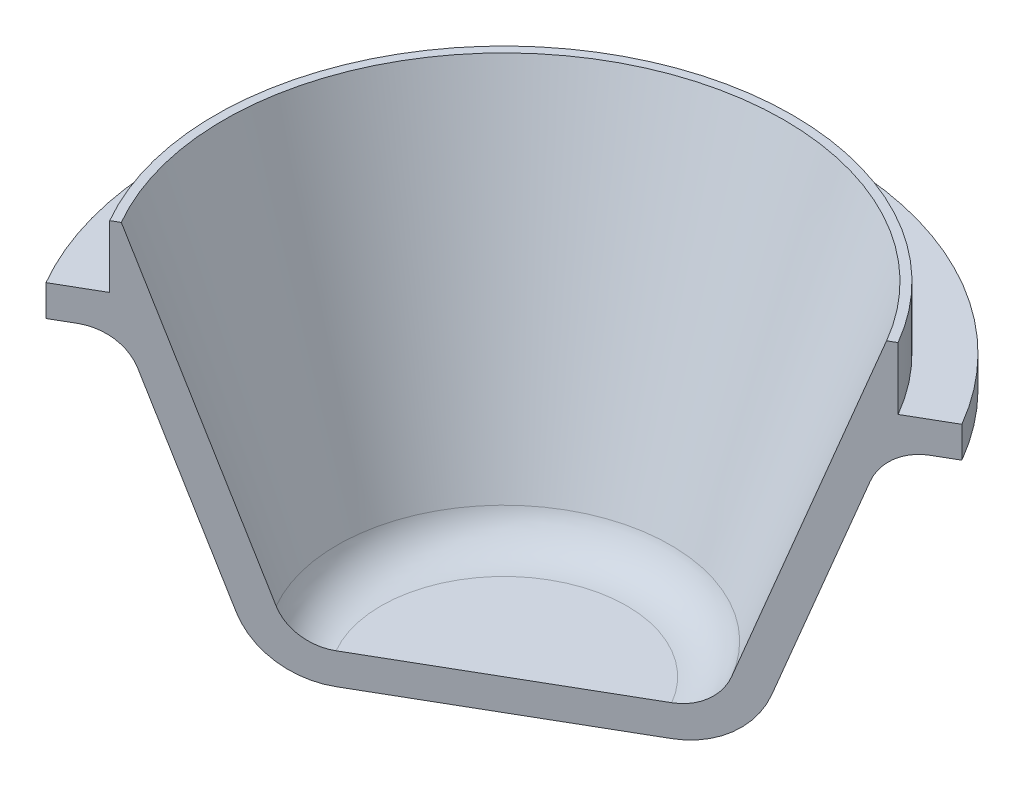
ISO-10303-21;
HEADER;
FILE_DESCRIPTION(('STEP AP214'),'2;1');
FILE_NAME('part.step','',(''),(''),'','','');
FILE_SCHEMA(('AUTOMOTIVE_DESIGN { 1 0 10303 214 1 1 1 1 }'));
ENDSEC;
DATA;
#1=APPLICATION_CONTEXT('core data for automotive mechanical design processes');
#2=APPLICATION_PROTOCOL_DEFINITION('international standard','automotive_design',2000,#1);
#3=PRODUCT_CONTEXT('',#1,'mechanical');
#4=PRODUCT('Part','Part','',(#3));
#5=PRODUCT_RELATED_PRODUCT_CATEGORY('part','',(#4));
#6=PRODUCT_DEFINITION_FORMATION('','',#4);
#7=PRODUCT_DEFINITION_CONTEXT('part definition',#1,'design');
#8=PRODUCT_DEFINITION('design','',#6,#7);
#9=PRODUCT_DEFINITION_SHAPE('','',#8);
#10=(LENGTH_UNIT() NAMED_UNIT(*) SI_UNIT(.MILLI.,.METRE.));
#11=(NAMED_UNIT(*) PLANE_ANGLE_UNIT() SI_UNIT($,.RADIAN.));
#12=(NAMED_UNIT(*) SI_UNIT($,.STERADIAN.) SOLID_ANGLE_UNIT());
#13=UNCERTAINTY_MEASURE_WITH_UNIT(LENGTH_MEASURE(1.E-05),#10,'distance_accuracy_value','');
#14=(GEOMETRIC_REPRESENTATION_CONTEXT(3) GLOBAL_UNCERTAINTY_ASSIGNED_CONTEXT((#13)) GLOBAL_UNIT_ASSIGNED_CONTEXT((#10,
#11,#12)) REPRESENTATION_CONTEXT('',''));
#15=CARTESIAN_POINT('',(0.,0.,0.));
#16=DIRECTION('',(0.,0.,1.));
#17=DIRECTION('',(1.,0.,0.));
#18=AXIS2_PLACEMENT_3D('',#15,#16,#17);
#19=CARTESIAN_POINT('',(5.,6.5,0.));
#20=DIRECTION('',(0.,1.,0.));
#21=DIRECTION('',(0.,0.,1.));
#22=AXIS2_PLACEMENT_3D('',#19,#20,#21);
#23=TOROIDAL_SURFACE('',#22,10.0262509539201,1.5);
#24=CARTESIAN_POINT('',(5.,7.0130302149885,0.));
#25=DIRECTION('',(0.,1.,0.));
#26=DIRECTION('',(0.,0.,1.));
#27=AXIS2_PLACEMENT_3D('',#24,#25,#26);
#28=CIRCLE('',#27,8.61671202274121);
#29=CARTESIAN_POINT('',(12.4622915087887,7.0130302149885,-4.30835601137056));
#30=VERTEX_POINT('',#29);
#31=CARTESIAN_POINT('',(-2.46229150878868,7.0130302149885,4.30835601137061));
#32=VERTEX_POINT('',#31);
#33=EDGE_CURVE('E13',#30,#32,#28,.T.);
#34=ORIENTED_EDGE('',*,*,#33,.T.);
#35=CARTESIAN_POINT('',(-3.68298803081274,6.5,5.01312547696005));
#36=DIRECTION('',(-0.500000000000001,0.,-0.866025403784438));
#37=DIRECTION('',(0.866025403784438,0.,-0.500000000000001));
#38=AXIS2_PLACEMENT_3D('',#35,#36,#37);
#39=CIRCLE('',#38,1.5);
#40=CARTESIAN_POINT('',(-3.68298803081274,8.,5.01312547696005));
#41=VERTEX_POINT('',#40);
#42=EDGE_CURVE('E167',#41,#32,#39,.T.);
#43=ORIENTED_EDGE('',*,*,#42,.F.);
#44=CARTESIAN_POINT('',(5.,8.,0.));
#45=DIRECTION('',(0.,1.,0.));
#46=DIRECTION('',(0.,0.,1.));
#47=AXIS2_PLACEMENT_3D('',#44,#45,#46);
#48=CIRCLE('',#47,10.0262509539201);
#49=CARTESIAN_POINT('',(13.6829880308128,8.,-5.01312547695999));
#50=VERTEX_POINT('',#49);
#51=EDGE_CURVE('E82',#50,#41,#48,.T.);
#52=ORIENTED_EDGE('',*,*,#51,.F.);
#53=CARTESIAN_POINT('',(13.6829880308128,6.5,-5.01312547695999));
#54=DIRECTION('',(0.499999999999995,0.,0.866025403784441));
#55=DIRECTION('',(-0.866025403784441,0.,0.499999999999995));
#56=AXIS2_PLACEMENT_3D('',#53,#54,#55);
#57=CIRCLE('',#56,1.5);
#58=EDGE_CURVE('E248',#50,#30,#57,.T.);
#59=ORIENTED_EDGE('',*,*,#58,.T.);
#60=EDGE_LOOP('',(#34,#43,#52,#59));
#61=FACE_BOUND('',#60,.T.);
#62=ADVANCED_FACE('F57',(#61),#23,.F.);
#63=CARTESIAN_POINT('',(5.,7.0130302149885,0.));
#64=DIRECTION('',(0.,1.,0.));
#65=DIRECTION('',(0.,0.,1.));
#66=AXIS2_PLACEMENT_3D('',#63,#64,#65);
#67=CONICAL_SURFACE('',#66,8.61671202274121,0.349065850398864);
#68=CARTESIAN_POINT('',(5.,0.644949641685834,0.));
#69=DIRECTION('',(0.,1.,0.));
#70=DIRECTION('',(0.,0.,1.));
#71=AXIS2_PLACEMENT_3D('',#68,#69,#70);
#72=CIRCLE('',#71,6.29892024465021);
#73=CARTESIAN_POINT('',(10.4550249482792,0.644949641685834,-3.14946012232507));
#74=VERTEX_POINT('',#73);
#75=CARTESIAN_POINT('',(-0.455024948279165,0.644949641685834,3.14946012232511));
#76=VERTEX_POINT('',#75);
#77=EDGE_CURVE('E66',#74,#76,#72,.T.);
#78=ORIENTED_EDGE('',*,*,#77,.T.);
#79=DIRECTION('',(0.296198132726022,-0.939692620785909,-0.171010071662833));
#80=VECTOR('',#79,1.);
#81=CARTESIAN_POINT('',(-0.455024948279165,0.644949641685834,3.14946012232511));
#82=LINE('',#81,#80);
#83=EDGE_CURVE('E181',#32,#76,#82,.T.);
#84=ORIENTED_EDGE('',*,*,#83,.F.);
#85=ORIENTED_EDGE('',*,*,#33,.F.);
#86=DIRECTION('',(-0.296198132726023,-0.939692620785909,0.171010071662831));
#87=VECTOR('',#86,1.);
#88=CARTESIAN_POINT('',(10.4550249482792,0.644949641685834,-3.14946012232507));
#89=LINE('',#88,#87);
#90=EDGE_CURVE('E230',#30,#74,#89,.T.);
#91=ORIENTED_EDGE('',*,*,#90,.T.);
#92=EDGE_LOOP('',(#78,#84,#85,#91));
#93=FACE_BOUND('',#92,.T.);
#94=ADVANCED_FACE('F59',(#93),#67,.T.);
#95=CARTESIAN_POINT('',(5.,1.5,0.));
#96=DIRECTION('',(0.,1.,0.));
#97=DIRECTION('',(0.,0.,1.));
#98=AXIS2_PLACEMENT_3D('',#95,#96,#97);
#99=TOROIDAL_SURFACE('',#98,3.94968869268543,2.5);
#100=CARTESIAN_POINT('',(5.,-1.,0.));
#101=DIRECTION('',(0.,1.,0.));
#102=DIRECTION('',(0.,0.,1.));
#103=AXIS2_PLACEMENT_3D('',#100,#101,#102);
#104=CIRCLE('',#103,3.94968869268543);
#105=CARTESIAN_POINT('',(8.42053074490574,-1.,-1.9748443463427));
#106=VERTEX_POINT('',#105);
#107=CARTESIAN_POINT('',(1.57946925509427,-1.,1.97484434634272));
#108=VERTEX_POINT('',#107);
#109=EDGE_CURVE('E224',#106,#108,#104,.T.);
#110=ORIENTED_EDGE('',*,*,#109,.T.);
#111=CARTESIAN_POINT('',(1.57946925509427,1.5,1.97484434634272));
#112=DIRECTION('',(0.500000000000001,0.,0.866025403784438));
#113=DIRECTION('',(-0.866025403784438,0.,0.500000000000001));
#114=AXIS2_PLACEMENT_3D('',#111,#112,#113);
#115=CIRCLE('',#114,2.5);
#116=EDGE_CURVE('E184',#76,#108,#115,.T.);
#117=ORIENTED_EDGE('',*,*,#116,.F.);
#118=ORIENTED_EDGE('',*,*,#77,.F.);
#119=CARTESIAN_POINT('',(8.42053074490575,1.5,-1.9748443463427));
#120=DIRECTION('',(-0.499999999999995,0.,-0.866025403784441));
#121=DIRECTION('',(0.866025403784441,0.,-0.499999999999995));
#122=AXIS2_PLACEMENT_3D('',#119,#120,#121);
#123=CIRCLE('',#122,2.5);
#124=EDGE_CURVE('E238',#74,#106,#123,.T.);
#125=ORIENTED_EDGE('',*,*,#124,.T.);
#126=EDGE_LOOP('',(#110,#117,#118,#125));
#127=FACE_BOUND('',#126,.T.);
#128=ADVANCED_FACE('F237',(#127),#99,.T.);
#129=CARTESIAN_POINT('',(5.,-1.,0.));
#130=DIRECTION('',(0.,-1.,0.));
#131=DIRECTION('',(0.,0.,-1.));
#132=AXIS2_PLACEMENT_3D('',#129,#130,#131);
#133=PLANE('',#132);
#134=DIRECTION('',(-0.866025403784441,0.,0.499999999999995));
#135=VECTOR('',#134,1.);
#136=CARTESIAN_POINT('',(5.,-1.,0.));
#137=LINE('',#136,#135);
#138=EDGE_CURVE('E241',#106,#108,#137,.T.);
#139=ORIENTED_EDGE('',*,*,#138,.T.);
#140=ORIENTED_EDGE('',*,*,#109,.F.);
#141=EDGE_LOOP('',(#139,#140));
#142=FACE_BOUND('',#141,.T.);
#143=ADVANCED_FACE('F240',(#142),#133,.T.);
#144=CARTESIAN_POINT('',(8.42053074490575,0.,-1.9748443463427));
#145=DIRECTION('',(0.,1.,0.));
#146=DIRECTION('',(0.,0.,1.));
#147=AXIS2_PLACEMENT_3D('',#144,#145,#146);
#148=PLANE('',#147);
#149=CARTESIAN_POINT('',(5.,0.,0.));
#150=DIRECTION('',(0.,1.,0.));
#151=DIRECTION('',(0.,0.,1.));
#152=AXIS2_PLACEMENT_3D('',#149,#150,#151);
#153=CIRCLE('',#152,3.94968869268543);
#154=CARTESIAN_POINT('',(8.42053074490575,0.,-1.9748443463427));
#155=VERTEX_POINT('',#154);
#156=CARTESIAN_POINT('',(1.57946925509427,0.,1.97484434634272));
#157=VERTEX_POINT('',#156);
#158=EDGE_CURVE('E221',#155,#157,#153,.T.);
#159=ORIENTED_EDGE('',*,*,#158,.T.);
#160=DIRECTION('',(0.866025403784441,0.,-0.499999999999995));
#161=VECTOR('',#160,1.);
#162=CARTESIAN_POINT('',(8.42053074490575,0.,-1.9748443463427));
#163=LINE('',#162,#161);
#164=EDGE_CURVE('E242',#157,#155,#163,.T.);
#165=ORIENTED_EDGE('',*,*,#164,.T.);
#166=EDGE_LOOP('',(#159,#165));
#167=FACE_BOUND('',#166,.T.);
#168=ADVANCED_FACE('F328',(#167),#148,.T.);
#169=CARTESIAN_POINT('',(5.,1.5,0.));
#170=DIRECTION('',(0.,1.,0.));
#171=DIRECTION('',(0.,0.,1.));
#172=AXIS2_PLACEMENT_3D('',#169,#170,#171);
#173=TOROIDAL_SURFACE('',#172,3.94968869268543,1.5);
#174=CARTESIAN_POINT('',(5.,0.986969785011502,0.));
#175=DIRECTION('',(0.,1.,0.));
#176=DIRECTION('',(0.,0.,1.));
#177=AXIS2_PLACEMENT_3D('',#174,#175,#176);
#178=CIRCLE('',#177,5.3592276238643);
#179=CARTESIAN_POINT('',(9.64122726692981,0.986969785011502,-2.67961381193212));
#180=VERTEX_POINT('',#179);
#181=CARTESIAN_POINT('',(0.358772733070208,0.986969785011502,2.67961381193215));
#182=VERTEX_POINT('',#181);
#183=EDGE_CURVE('E218',#180,#182,#178,.T.);
#184=ORIENTED_EDGE('',*,*,#183,.T.);
#185=CARTESIAN_POINT('',(1.57946925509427,1.5,1.97484434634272));
#186=DIRECTION('',(-0.500000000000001,0.,-0.866025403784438));
#187=DIRECTION('',(0.866025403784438,0.,-0.500000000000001));
#188=AXIS2_PLACEMENT_3D('',#185,#186,#187);
#189=CIRCLE('',#188,1.5);
#190=EDGE_CURVE('E187',#157,#182,#189,.T.);
#191=ORIENTED_EDGE('',*,*,#190,.F.);
#192=ORIENTED_EDGE('',*,*,#158,.F.);
#193=CARTESIAN_POINT('',(8.42053074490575,1.5,-1.9748443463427));
#194=DIRECTION('',(0.499999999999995,0.,0.866025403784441));
#195=DIRECTION('',(-0.866025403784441,0.,0.499999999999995));
#196=AXIS2_PLACEMENT_3D('',#193,#194,#195);
#197=CIRCLE('',#196,1.5);
#198=EDGE_CURVE('E205',#155,#180,#197,.T.);
#199=ORIENTED_EDGE('',*,*,#198,.T.);
#200=EDGE_LOOP('',(#184,#191,#192,#199));
#201=FACE_BOUND('',#200,.T.);
#202=ADVANCED_FACE('F306',(#201),#173,.F.);
#203=CARTESIAN_POINT('',(5.,0.986969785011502,0.));
#204=DIRECTION('',(0.,1.,0.));
#205=DIRECTION('',(0.,0.,1.));
#206=AXIS2_PLACEMENT_3D('',#203,#204,#205);
#207=CONICAL_SURFACE('',#206,5.3592276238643,0.349065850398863);
#208=DIRECTION('',(0.296198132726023,0.939692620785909,-0.171010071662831));
#209=VECTOR('',#208,1.);
#210=CARTESIAN_POINT('',(12.1669942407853,9.,-4.13786605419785));
#211=LINE('',#210,#209);
#212=CARTESIAN_POINT('',(12.7974091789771,11.,-4.50183628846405));
#213=VERTEX_POINT('',#212);
#214=EDGE_CURVE('E201',#180,#213,#211,.T.);
#215=ORIENTED_EDGE('',*,*,#214,.T.);
#216=CARTESIAN_POINT('',(5.,11.,0.));
#217=DIRECTION('',(0.,1.,0.));
#218=DIRECTION('',(0.,0.,1.));
#219=AXIS2_PLACEMENT_3D('',#216,#217,#218);
#220=CIRCLE('',#219,9.00367257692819);
#221=CARTESIAN_POINT('',(-2.79740917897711,11.,4.5018362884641));
#222=VERTEX_POINT('',#221);
#223=EDGE_CURVE('E159',#222,#213,#220,.F.);
#224=ORIENTED_EDGE('',*,*,#223,.F.);
#225=DIRECTION('',(-0.296198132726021,0.939692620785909,0.171010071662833));
#226=VECTOR('',#225,1.);
#227=CARTESIAN_POINT('',(-2.1669942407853,9.,4.1378660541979));
#228=LINE('',#227,#226);
#229=EDGE_CURVE('E149',#182,#222,#228,.T.);
#230=ORIENTED_EDGE('',*,*,#229,.F.);
#231=ORIENTED_EDGE('',*,*,#183,.F.);
#232=EDGE_LOOP('',(#215,#224,#230,#231));
#233=FACE_BOUND('',#232,.T.);
#234=ADVANCED_FACE('F264',(#233),#207,.F.);
#235=CARTESIAN_POINT('',(14.3320577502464,9.,-5.38786605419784));
#236=DIRECTION('',(0.,1.,0.));
#237=DIRECTION('',(0.,0.,1.));
#238=AXIS2_PLACEMENT_3D('',#235,#236,#237);
#239=PLANE('',#238);
#240=CARTESIAN_POINT('',(5.,9.,0.));
#241=DIRECTION('',(0.,1.,0.));
#242=DIRECTION('',(0.,0.,1.));
#243=AXIS2_PLACEMENT_3D('',#240,#241,#242);
#244=CIRCLE('',#243,9.27573210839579);
#245=CARTESIAN_POINT('',(13.0330196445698,9.,-4.63786605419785));
#246=VERTEX_POINT('',#245);
#247=CARTESIAN_POINT('',(-3.03301964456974,9.,4.63786605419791));
#248=VERTEX_POINT('',#247);
#249=EDGE_CURVE('E74',#246,#248,#244,.T.);
#250=ORIENTED_EDGE('',*,*,#249,.F.);
#251=DIRECTION('',(0.866025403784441,0.,-0.499999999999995));
#252=VECTOR('',#251,1.);
#253=CARTESIAN_POINT('',(14.3320577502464,9.,-5.38786605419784));
#254=LINE('',#253,#252);
#255=CARTESIAN_POINT('',(14.3320577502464,9.,-5.38786605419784));
#256=VERTEX_POINT('',#255);
#257=EDGE_CURVE('E198',#246,#256,#254,.T.);
#258=ORIENTED_EDGE('',*,*,#257,.T.);
#259=CARTESIAN_POINT('',(5.,9.,0.));
#260=DIRECTION('',(0.,1.,0.));
#261=DIRECTION('',(0.,0.,1.));
#262=AXIS2_PLACEMENT_3D('',#259,#260,#261);
#263=CIRCLE('',#262,10.7757321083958);
#264=CARTESIAN_POINT('',(-4.3320577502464,9.,5.38786605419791));
#265=VERTEX_POINT('',#264);
#266=EDGE_CURVE('E144',#256,#265,#263,.T.);
#267=ORIENTED_EDGE('',*,*,#266,.T.);
#268=DIRECTION('',(-0.866025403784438,0.,0.500000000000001));
#269=VECTOR('',#268,1.);
#270=CARTESIAN_POINT('',(-4.3320577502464,9.,5.38786605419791));
#271=LINE('',#270,#269);
#272=EDGE_CURVE('E140',#248,#265,#271,.T.);
#273=ORIENTED_EDGE('',*,*,#272,.F.);
#274=EDGE_LOOP('',(#250,#258,#267,#273));
#275=FACE_BOUND('',#274,.T.);
#276=ADVANCED_FACE('F142',(#275),#239,.T.);
#277=CARTESIAN_POINT('',(5.,-1.,0.));
#278=DIRECTION('',(0.,1.,0.));
#279=DIRECTION('',(0.,0.,1.));
#280=AXIS2_PLACEMENT_3D('',#277,#278,#279);
#281=CYLINDRICAL_SURFACE('',#280,10.7757321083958);
#282=CARTESIAN_POINT('',(5.,8.,0.));
#283=DIRECTION('',(0.,1.,0.));
#284=DIRECTION('',(0.,0.,1.));
#285=AXIS2_PLACEMENT_3D('',#282,#283,#284);
#286=CIRCLE('',#285,10.7757321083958);
#287=CARTESIAN_POINT('',(14.3320577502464,8.,-5.38786605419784));
#288=VERTEX_POINT('',#287);
#289=CARTESIAN_POINT('',(-4.3320577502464,8.,5.38786605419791));
#290=VERTEX_POINT('',#289);
#291=EDGE_CURVE('E214',#288,#290,#286,.T.);
#292=ORIENTED_EDGE('',*,*,#291,.T.);
#293=DIRECTION('',(0.,-1.,0.));
#294=VECTOR('',#293,1.);
#295=CARTESIAN_POINT('',(-4.3320577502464,8.,5.38786605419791));
#296=LINE('',#295,#294);
#297=EDGE_CURVE('E148',#265,#290,#296,.T.);
#298=ORIENTED_EDGE('',*,*,#297,.F.);
#299=ORIENTED_EDGE('',*,*,#266,.F.);
#300=DIRECTION('',(0.,-1.,0.));
#301=VECTOR('',#300,1.);
#302=CARTESIAN_POINT('',(14.3320577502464,8.,-5.38786605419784));
#303=LINE('',#302,#301);
#304=EDGE_CURVE('E200',#256,#288,#303,.T.);
#305=ORIENTED_EDGE('',*,*,#304,.T.);
#306=EDGE_LOOP('',(#292,#298,#299,#305));
#307=FACE_BOUND('',#306,.T.);
#308=ADVANCED_FACE('F256',(#307),#281,.T.);
#309=CARTESIAN_POINT('',(13.6829880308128,8.,-5.01312547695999));
#310=DIRECTION('',(0.,-1.,0.));
#311=DIRECTION('',(0.,0.,-1.));
#312=AXIS2_PLACEMENT_3D('',#309,#310,#311);
#313=PLANE('',#312);
#314=DIRECTION('',(-0.866025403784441,0.,0.499999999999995));
#315=VECTOR('',#314,1.);
#316=CARTESIAN_POINT('',(13.6829880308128,8.,-5.01312547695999));
#317=LINE('',#316,#315);
#318=EDGE_CURVE('E210',#288,#50,#317,.T.);
#319=ORIENTED_EDGE('',*,*,#318,.T.);
#320=ORIENTED_EDGE('',*,*,#51,.T.);
#321=DIRECTION('',(0.866025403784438,0.,-0.500000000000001));
#322=VECTOR('',#321,1.);
#323=CARTESIAN_POINT('',(-3.68298803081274,8.,5.01312547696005));
#324=LINE('',#323,#322);
#325=EDGE_CURVE('E249',#290,#41,#324,.T.);
#326=ORIENTED_EDGE('',*,*,#325,.F.);
#327=ORIENTED_EDGE('',*,*,#291,.F.);
#328=EDGE_LOOP('',(#319,#320,#326,#327));
#329=FACE_BOUND('',#328,.T.);
#330=ADVANCED_FACE('F253',(#329),#313,.T.);
#331=CARTESIAN_POINT('',(13.6829880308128,6.5,-5.01312547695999));
#332=DIRECTION('',(-0.499999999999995,0.,-0.866025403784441));
#333=DIRECTION('',(-0.866025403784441,0.,0.499999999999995));
#334=AXIS2_PLACEMENT_3D('',#331,#332,#333);
#335=PLANE('',#334);
#336=ORIENTED_EDGE('',*,*,#58,.F.);
#337=ORIENTED_EDGE('',*,*,#318,.F.);
#338=ORIENTED_EDGE('',*,*,#304,.F.);
#339=ORIENTED_EDGE('',*,*,#257,.F.);
#340=DIRECTION('',(0.,-1.,0.));
#341=VECTOR('',#340,1.);
#342=CARTESIAN_POINT('',(13.0330196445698,11.,-4.63786605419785));
#343=LINE('',#342,#341);
#344=CARTESIAN_POINT('',(13.0330196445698,11.,-4.63786605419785));
#345=VERTEX_POINT('',#344);
#346=EDGE_CURVE('E164',#345,#246,#343,.T.);
#347=ORIENTED_EDGE('',*,*,#346,.F.);
#348=DIRECTION('',(0.866025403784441,0.,-0.499999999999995));
#349=VECTOR('',#348,1.);
#350=CARTESIAN_POINT('',(14.3320577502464,11.,-5.38786605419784));
#351=LINE('',#350,#349);
#352=EDGE_CURVE('E169',#213,#345,#351,.T.);
#353=ORIENTED_EDGE('',*,*,#352,.F.);
#354=ORIENTED_EDGE('',*,*,#214,.F.);
#355=ORIENTED_EDGE('',*,*,#198,.F.);
#356=ORIENTED_EDGE('',*,*,#164,.F.);
#357=ORIENTED_EDGE('',*,*,#190,.T.);
#358=ORIENTED_EDGE('',*,*,#229,.T.);
#359=DIRECTION('',(-0.866025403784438,0.,0.500000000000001));
#360=VECTOR('',#359,1.);
#361=CARTESIAN_POINT('',(-4.3320577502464,11.,5.38786605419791));
#362=LINE('',#361,#360);
#363=CARTESIAN_POINT('',(-3.03301964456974,11.,4.63786605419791));
#364=VERTEX_POINT('',#363);
#365=EDGE_CURVE('E155',#222,#364,#362,.T.);
#366=ORIENTED_EDGE('',*,*,#365,.T.);
#367=DIRECTION('',(0.,-1.,0.));
#368=VECTOR('',#367,1.);
#369=CARTESIAN_POINT('',(-3.03301964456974,11.,4.63786605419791));
#370=LINE('',#369,#368);
#371=EDGE_CURVE('E152',#364,#248,#370,.T.);
#372=ORIENTED_EDGE('',*,*,#371,.T.);
#373=ORIENTED_EDGE('',*,*,#272,.T.);
#374=ORIENTED_EDGE('',*,*,#297,.T.);
#375=ORIENTED_EDGE('',*,*,#325,.T.);
#376=ORIENTED_EDGE('',*,*,#42,.T.);
#377=ORIENTED_EDGE('',*,*,#83,.T.);
#378=ORIENTED_EDGE('',*,*,#116,.T.);
#379=ORIENTED_EDGE('',*,*,#138,.F.);
#380=ORIENTED_EDGE('',*,*,#124,.F.);
#381=ORIENTED_EDGE('',*,*,#90,.F.);
#382=EDGE_LOOP('',(#336,#337,#338,#339,#347,#353,#354,#355,#356,#357,#358,#366,#372,#373,#374,
#375,#376,#377,#378,#379,#380,#381));
#383=FACE_BOUND('',#382,.T.);
#384=ADVANCED_FACE('F153',(#383),#335,.F.);
#385=CARTESIAN_POINT('',(14.3320577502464,11.,-5.38786605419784));
#386=DIRECTION('',(0.,1.,0.));
#387=DIRECTION('',(0.,0.,1.));
#388=AXIS2_PLACEMENT_3D('',#385,#386,#387);
#389=PLANE('',#388);
#390=ORIENTED_EDGE('',*,*,#365,.F.);
#391=ORIENTED_EDGE('',*,*,#223,.T.);
#392=ORIENTED_EDGE('',*,*,#352,.T.);
#393=CARTESIAN_POINT('',(5.,11.,0.));
#394=DIRECTION('',(0.,1.,0.));
#395=DIRECTION('',(0.,0.,1.));
#396=AXIS2_PLACEMENT_3D('',#393,#394,#395);
#397=CIRCLE('',#396,9.27573210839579);
#398=EDGE_CURVE('E165',#345,#364,#397,.T.);
#399=ORIENTED_EDGE('',*,*,#398,.T.);
#400=EDGE_LOOP('',(#390,#391,#392,#399));
#401=FACE_BOUND('',#400,.T.);
#402=ADVANCED_FACE('F274',(#401),#389,.T.);
#403=CARTESIAN_POINT('',(5.,11.,0.));
#404=DIRECTION('',(0.,-1.,0.));
#405=DIRECTION('',(0.,0.,-1.));
#406=AXIS2_PLACEMENT_3D('',#403,#404,#405);
#407=CYLINDRICAL_SURFACE('',#406,9.27573210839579);
#408=ORIENTED_EDGE('',*,*,#249,.T.);
#409=ORIENTED_EDGE('',*,*,#371,.F.);
#410=ORIENTED_EDGE('',*,*,#398,.F.);
#411=ORIENTED_EDGE('',*,*,#346,.T.);
#412=EDGE_LOOP('',(#408,#409,#410,#411));
#413=FACE_BOUND('',#412,.T.);
#414=ADVANCED_FACE('F162',(#413),#407,.T.);
#415=CLOSED_SHELL('',(#62,#94,#128,#143,#168,#202,#234,#276,#308,#330,#384,#402,#414));
#416=MANIFOLD_SOLID_BREP('B2',#415);
#417=ADVANCED_BREP_SHAPE_REPRESENTATION('',(#18,#416),#14);
#418=SHAPE_DEFINITION_REPRESENTATION(#9,#417);
ENDSEC;
END-ISO-10303-21;
